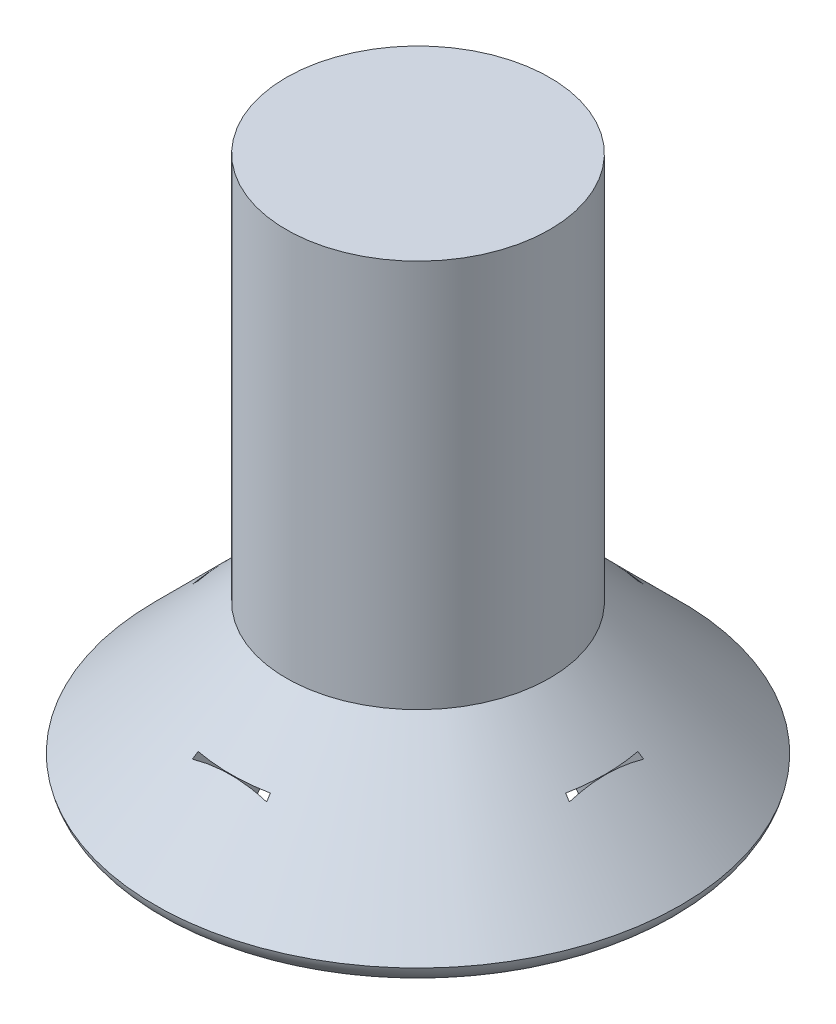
ISO-10303-21;
HEADER;
FILE_DESCRIPTION(('STEP AP214'),'2;1');
FILE_NAME('part.step','',(''),(''),'','','');
FILE_SCHEMA(('AUTOMOTIVE_DESIGN { 1 0 10303 214 1 1 1 1 }'));
ENDSEC;
DATA;
#1=APPLICATION_CONTEXT('core data for automotive mechanical design processes');
#2=APPLICATION_PROTOCOL_DEFINITION('international standard','automotive_design',2000,#1);
#3=PRODUCT_CONTEXT('',#1,'mechanical');
#4=PRODUCT('Part','Part','',(#3));
#5=PRODUCT_RELATED_PRODUCT_CATEGORY('part','',(#4));
#6=PRODUCT_DEFINITION_FORMATION('','',#4);
#7=PRODUCT_DEFINITION_CONTEXT('part definition',#1,'design');
#8=PRODUCT_DEFINITION('design','',#6,#7);
#9=PRODUCT_DEFINITION_SHAPE('','',#8);
#10=(LENGTH_UNIT() NAMED_UNIT(*) SI_UNIT(.MILLI.,.METRE.));
#11=(NAMED_UNIT(*) PLANE_ANGLE_UNIT() SI_UNIT($,.RADIAN.));
#12=(NAMED_UNIT(*) SI_UNIT($,.STERADIAN.) SOLID_ANGLE_UNIT());
#13=UNCERTAINTY_MEASURE_WITH_UNIT(LENGTH_MEASURE(1.E-05),#10,'distance_accuracy_value','');
#14=(GEOMETRIC_REPRESENTATION_CONTEXT(3) GLOBAL_UNCERTAINTY_ASSIGNED_CONTEXT((#13)) GLOBAL_UNIT_ASSIGNED_CONTEXT((#10,
#11,#12)) REPRESENTATION_CONTEXT('',''));
#15=CARTESIAN_POINT('',(0.,0.,0.));
#16=DIRECTION('',(0.,0.,1.));
#17=DIRECTION('',(1.,0.,0.));
#18=AXIS2_PLACEMENT_3D('',#15,#16,#17);
#19=CARTESIAN_POINT('',(0.,3.9,0.));
#20=DIRECTION('',(0.,1.,0.));
#21=DIRECTION('',(-1.,0.,0.));
#22=AXIS2_PLACEMENT_3D('',#19,#20,#21);
#23=PLANE('',#22);
#24=CARTESIAN_POINT('',(0.,3.9,0.));
#25=DIRECTION('',(0.,-1.,0.));
#26=DIRECTION('',(1.,0.,0.));
#27=AXIS2_PLACEMENT_3D('',#24,#25,#26);
#28=CIRCLE('',#27,0.95);
#29=CARTESIAN_POINT('',(0.949999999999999,3.9,0.));
#30=VERTEX_POINT('',#29);
#31=EDGE_CURVE('E439',#30,#30,#28,.T.);
#32=ORIENTED_EDGE('',*,*,#31,.F.);
#33=EDGE_LOOP('',(#32));
#34=FACE_BOUND('',#33,.T.);
#35=ADVANCED_FACE('F33',(#34),#23,.T.);
#36=CARTESIAN_POINT('',(0.,0.,0.));
#37=DIRECTION('',(0.,-1.,0.));
#38=DIRECTION('',(1.,0.,0.));
#39=AXIS2_PLACEMENT_3D('',#36,#37,#38);
#40=CYLINDRICAL_SURFACE('',#39,0.95);
#41=ORIENTED_EDGE('',*,*,#31,.T.);
#42=EDGE_LOOP('',(#41));
#43=FACE_BOUND('',#42,.T.);
#44=CARTESIAN_POINT('',(0.,1.1,0.));
#45=DIRECTION('',(0.,-1.,0.));
#46=DIRECTION('',(1.,0.,0.));
#47=AXIS2_PLACEMENT_3D('',#44,#45,#46);
#48=CIRCLE('',#47,0.950000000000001);
#49=CARTESIAN_POINT('',(0.95,1.1,0.));
#50=VERTEX_POINT('',#49);
#51=EDGE_CURVE('E440',#50,#50,#48,.T.);
#52=ORIENTED_EDGE('',*,*,#51,.F.);
#53=EDGE_LOOP('',(#52));
#54=FACE_BOUND('',#53,.T.);
#55=ADVANCED_FACE('F427',(#43,#54),#40,.T.);
#56=CARTESIAN_POINT('',(0.,0.155104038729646,0.));
#57=DIRECTION('',(0.,-1.,0.));
#58=DIRECTION('',(1.,0.,0.));
#59=AXIS2_PLACEMENT_3D('',#56,#57,#58);
#60=CONICAL_SURFACE('',#59,1.89489596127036,0.785398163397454);
#61=CARTESIAN_POINT('',(-1.32448150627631,0.7002,-0.260209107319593));
#62=CARTESIAN_POINT('',(-1.35376827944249,0.670234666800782,-0.266578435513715));
#63=CARTESIAN_POINT('',(-1.38305487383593,0.640269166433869,-0.272947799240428));
#64=CARTESIAN_POINT('',(-1.44162770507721,0.580337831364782,-0.285686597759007));
#65=CARTESIAN_POINT('',(-1.47091394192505,0.550371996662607,-0.292056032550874));
#66=CARTESIAN_POINT('',(-1.50020000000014,0.520405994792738,-0.298425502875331));
#67=B_SPLINE_CURVE_WITH_KNOTS('',3,(#61,#62,#63,#64,#65,#66),.UNSPECIFIED.,.F.,.F.,(4,2,4),(0.,
0.127144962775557,0.254289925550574),.UNSPECIFIED.);
#68=CARTESIAN_POINT('',(-1.32467697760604,0.7,-0.260251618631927));
#69=VERTEX_POINT('',#68);
#70=CARTESIAN_POINT('',(-1.35858474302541,0.665306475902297,-0.267625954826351));
#71=VERTEX_POINT('',#70);
#72=EDGE_CURVE('E366',#69,#71,#67,.T.);
#73=ORIENTED_EDGE('',*,*,#72,.F.);
#74=CARTESIAN_POINT('',(0.,0.7,0.));
#75=DIRECTION('',(0.,-1.,0.));
#76=DIRECTION('',(0.,0.,-1.));
#77=AXIS2_PLACEMENT_3D('',#74,#75,#76);
#78=CIRCLE('',#77,1.35);
#79=CARTESIAN_POINT('',(-1.32467697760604,0.7,0.260251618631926));
#80=VERTEX_POINT('',#79);
#81=EDGE_CURVE('E11',#69,#80,#78,.F.);
#82=ORIENTED_EDGE('',*,*,#81,.T.);
#83=CARTESIAN_POINT('',(-1.5002,0.520405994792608,0.298425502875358));
#84=CARTESIAN_POINT('',(-1.47091394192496,0.550371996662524,0.292056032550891));
#85=CARTESIAN_POINT('',(-1.44162770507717,0.580337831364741,0.285686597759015));
#86=CARTESIAN_POINT('',(-1.38305487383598,0.64026916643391,0.272947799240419));
#87=CARTESIAN_POINT('',(-1.35376827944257,0.67023466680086,0.266578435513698));
#88=CARTESIAN_POINT('',(-1.32448150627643,0.700200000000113,0.260209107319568));
#89=B_SPLINE_CURVE_WITH_KNOTS('',3,(#83,#84,#85,#86,#87,#88),.UNSPECIFIED.,.F.,.F.,(4,2,4),(0.,
0.127144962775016,0.254289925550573),.UNSPECIFIED.);
#90=CARTESIAN_POINT('',(-1.35858474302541,0.665306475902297,0.26762595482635));
#91=VERTEX_POINT('',#90);
#92=EDGE_CURVE('E337',#91,#80,#89,.T.);
#93=ORIENTED_EDGE('',*,*,#92,.F.);
#94=CARTESIAN_POINT('',(-1.36770975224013,0.622376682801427,-0.409241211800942));
#95=CARTESIAN_POINT('',(-1.36511595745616,0.63457952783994,-0.375372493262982));
#96=CARTESIAN_POINT('',(-1.36277166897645,0.645608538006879,-0.341021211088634));
#97=CARTESIAN_POINT('',(-1.35867523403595,0.664880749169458,-0.271430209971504));
#98=CARTESIAN_POINT('',(-1.35692448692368,0.67311736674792,-0.236188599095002));
#99=CARTESIAN_POINT('',(-1.35417014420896,0.68607553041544,-0.16629238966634));
#100=CARTESIAN_POINT('',(-1.35314265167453,0.690909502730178,-0.131660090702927));
#101=CARTESIAN_POINT('',(-1.35180273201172,0.697213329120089,-0.0621136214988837));
#102=CARTESIAN_POINT('',(-1.35148944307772,0.698687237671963,-0.027199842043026));
#103=CARTESIAN_POINT('',(-1.35159476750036,0.698191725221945,0.0413625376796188));
#104=CARTESIAN_POINT('',(-1.35198783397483,0.696342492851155,0.0750121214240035));
#105=CARTESIAN_POINT('',(-1.35343241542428,0.689546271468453,0.142015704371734));
#106=CARTESIAN_POINT('',(-1.35448465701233,0.684595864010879,0.17536933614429));
#107=CARTESIAN_POINT('',(-1.35723551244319,0.671654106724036,0.242648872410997));
#108=CARTESIAN_POINT('',(-1.35895536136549,0.663562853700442,0.276554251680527));
#109=CARTESIAN_POINT('',(-1.36294376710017,0.644798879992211,0.343533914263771));
#110=CARTESIAN_POINT('',(-1.36521110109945,0.634131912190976,0.376609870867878));
#111=CARTESIAN_POINT('',(-1.36770975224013,0.622376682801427,0.409241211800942));
#112=B_SPLINE_CURVE_WITH_KNOTS('',3,(#94,#95,#96,#97,#98,#99,#100,#101,#102,#103,#104,#105,#106,
#107,#108,#109,#110,#111),.UNSPECIFIED.,.F.,.F.,(4,2,2,2,2,2,2,2,4),(0.,0.108315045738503,
0.21688371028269,0.321671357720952,0.426332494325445,0.527284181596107,0.628347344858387,
0.732930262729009,0.837281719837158),.UNSPECIFIED.);
#113=EDGE_CURVE('E343',#71,#91,#112,.T.);
#114=ORIENTED_EDGE('',*,*,#113,.F.);
#115=EDGE_LOOP('',(#73,#82,#93,#114));
#116=FACE_BOUND('',#115,.T.);
#117=CARTESIAN_POINT('',(-0.260209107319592,0.7002,1.32448150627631));
#118=CARTESIAN_POINT('',(-0.266578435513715,0.670234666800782,1.35376827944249));
#119=CARTESIAN_POINT('',(-0.272947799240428,0.640269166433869,1.38305487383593));
#120=CARTESIAN_POINT('',(-0.285686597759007,0.580337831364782,1.44162770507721));
#121=CARTESIAN_POINT('',(-0.292056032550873,0.550371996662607,1.47091394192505));
#122=CARTESIAN_POINT('',(-0.29842550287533,0.520405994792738,1.50020000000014));
#123=B_SPLINE_CURVE_WITH_KNOTS('',3,(#117,#118,#119,#120,#121,#122),.UNSPECIFIED.,.F.,.F.,(4,2,
4),(0.,0.127144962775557,0.254289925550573),.UNSPECIFIED.);
#124=CARTESIAN_POINT('',(-0.260251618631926,0.7,1.32467697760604));
#125=VERTEX_POINT('',#124);
#126=CARTESIAN_POINT('',(-0.26762595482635,0.665306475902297,1.35858474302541));
#127=VERTEX_POINT('',#126);
#128=EDGE_CURVE('E332',#125,#127,#123,.T.);
#129=ORIENTED_EDGE('',*,*,#128,.F.);
#130=CARTESIAN_POINT('',(0.260251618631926,0.7,1.32467697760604));
#131=VERTEX_POINT('',#130);
#132=EDGE_CURVE('E41',#125,#131,#78,.F.);
#133=ORIENTED_EDGE('',*,*,#132,.T.);
#134=CARTESIAN_POINT('',(0.298425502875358,0.520405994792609,1.5002));
#135=CARTESIAN_POINT('',(0.292056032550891,0.550371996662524,1.47091394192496));
#136=CARTESIAN_POINT('',(0.285686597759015,0.580337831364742,1.44162770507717));
#137=CARTESIAN_POINT('',(0.272947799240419,0.64026916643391,1.38305487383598));
#138=CARTESIAN_POINT('',(0.266578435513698,0.67023466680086,1.35376827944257));
#139=CARTESIAN_POINT('',(0.260209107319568,0.700200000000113,1.32448150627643));
#140=B_SPLINE_CURVE_WITH_KNOTS('',3,(#134,#135,#136,#137,#138,#139),.UNSPECIFIED.,.F.,.F.,(4,2,
4),(0.,0.127144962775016,0.254289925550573),.UNSPECIFIED.);
#141=CARTESIAN_POINT('',(0.26762595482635,0.665306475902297,1.35858474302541));
#142=VERTEX_POINT('',#141);
#143=EDGE_CURVE('E296',#142,#131,#140,.T.);
#144=ORIENTED_EDGE('',*,*,#143,.F.);
#145=CARTESIAN_POINT('',(-0.409241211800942,0.622376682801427,1.36770975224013));
#146=CARTESIAN_POINT('',(-0.375372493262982,0.634579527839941,1.36511595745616));
#147=CARTESIAN_POINT('',(-0.341021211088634,0.645608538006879,1.36277166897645));
#148=CARTESIAN_POINT('',(-0.271430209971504,0.664880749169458,1.35867523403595));
#149=CARTESIAN_POINT('',(-0.236188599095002,0.673117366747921,1.35692448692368));
#150=CARTESIAN_POINT('',(-0.16629238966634,0.68607553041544,1.35417014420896));
#151=CARTESIAN_POINT('',(-0.131660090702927,0.690909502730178,1.35314265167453));
#152=CARTESIAN_POINT('',(-0.0621136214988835,0.69721332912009,1.35180273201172));
#153=CARTESIAN_POINT('',(-0.0271998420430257,0.698687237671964,1.35148944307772));
#154=CARTESIAN_POINT('',(0.041362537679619,0.698191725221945,1.35159476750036));
#155=CARTESIAN_POINT('',(0.0750121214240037,0.696342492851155,1.35198783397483));
#156=CARTESIAN_POINT('',(0.142015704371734,0.689546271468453,1.35343241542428));
#157=CARTESIAN_POINT('',(0.17536933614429,0.684595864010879,1.35448465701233));
#158=CARTESIAN_POINT('',(0.242648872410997,0.671654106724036,1.35723551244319));
#159=CARTESIAN_POINT('',(0.276554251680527,0.663562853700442,1.35895536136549));
#160=CARTESIAN_POINT('',(0.343533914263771,0.644798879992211,1.36294376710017));
#161=CARTESIAN_POINT('',(0.376609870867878,0.634131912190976,1.36521110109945));
#162=CARTESIAN_POINT('',(0.409241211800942,0.622376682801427,1.36770975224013));
#163=B_SPLINE_CURVE_WITH_KNOTS('',3,(#145,#146,#147,#148,#149,#150,#151,#152,#153,#154,#155,
#156,#157,#158,#159,#160,#161,#162),.UNSPECIFIED.,.F.,.F.,(4,2,2,2,2,2,2,2,4),(0.,
0.108315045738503,0.21688371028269,0.321671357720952,0.426332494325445,0.527284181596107,
0.628347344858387,0.732930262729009,0.837281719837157),.UNSPECIFIED.);
#164=EDGE_CURVE('E327',#127,#142,#163,.T.);
#165=ORIENTED_EDGE('',*,*,#164,.F.);
#166=EDGE_LOOP('',(#129,#133,#144,#165));
#167=FACE_BOUND('',#166,.T.);
#168=CARTESIAN_POINT('',(1.36770975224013,0.622376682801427,0.409241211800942));
#169=CARTESIAN_POINT('',(1.36511595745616,0.634579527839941,0.375372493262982));
#170=CARTESIAN_POINT('',(1.36277166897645,0.645608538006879,0.341021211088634));
#171=CARTESIAN_POINT('',(1.35867523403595,0.664880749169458,0.271430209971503));
#172=CARTESIAN_POINT('',(1.35692448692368,0.673117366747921,0.236188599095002));
#173=CARTESIAN_POINT('',(1.35417014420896,0.68607553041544,0.16629238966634));
#174=CARTESIAN_POINT('',(1.35314265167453,0.690909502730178,0.131660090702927));
#175=CARTESIAN_POINT('',(1.35180273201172,0.69721332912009,0.0621136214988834));
#176=CARTESIAN_POINT('',(1.35148944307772,0.698687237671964,0.0271998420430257));
#177=CARTESIAN_POINT('',(1.35159476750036,0.698191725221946,-0.0413625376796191));
#178=CARTESIAN_POINT('',(1.35198783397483,0.696342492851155,-0.0750121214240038));
#179=CARTESIAN_POINT('',(1.35343241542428,0.689546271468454,-0.142015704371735));
#180=CARTESIAN_POINT('',(1.35448465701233,0.684595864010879,-0.17536933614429));
#181=CARTESIAN_POINT('',(1.35723551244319,0.671654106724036,-0.242648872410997));
#182=CARTESIAN_POINT('',(1.35895536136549,0.663562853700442,-0.276554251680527));
#183=CARTESIAN_POINT('',(1.36294376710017,0.644798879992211,-0.343533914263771));
#184=CARTESIAN_POINT('',(1.36521110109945,0.634131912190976,-0.376609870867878));
#185=CARTESIAN_POINT('',(1.36770975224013,0.622376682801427,-0.409241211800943));
#186=B_SPLINE_CURVE_WITH_KNOTS('',3,(#168,#169,#170,#171,#172,#173,#174,#175,#176,#177,#178,
#179,#180,#181,#182,#183,#184,#185),.UNSPECIFIED.,.F.,.F.,(4,2,2,2,2,2,2,2,4),(0.,
0.108315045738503,0.21688371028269,0.321671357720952,0.426332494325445,0.527284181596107,
0.628347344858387,0.732930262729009,0.837281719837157),.UNSPECIFIED.);
#187=CARTESIAN_POINT('',(1.35858474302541,0.665306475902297,0.26762595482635));
#188=VERTEX_POINT('',#187);
#189=CARTESIAN_POINT('',(1.35858474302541,0.665306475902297,-0.26762595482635));
#190=VERTEX_POINT('',#189);
#191=EDGE_CURVE('E410',#188,#190,#186,.T.);
#192=ORIENTED_EDGE('',*,*,#191,.F.);
#193=CARTESIAN_POINT('',(1.32448150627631,0.7002,0.260209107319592));
#194=CARTESIAN_POINT('',(1.35376827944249,0.670234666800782,0.266578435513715));
#195=CARTESIAN_POINT('',(1.38305487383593,0.640269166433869,0.272947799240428));
#196=CARTESIAN_POINT('',(1.44162770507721,0.580337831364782,0.285686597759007));
#197=CARTESIAN_POINT('',(1.47091394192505,0.550371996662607,0.292056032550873));
#198=CARTESIAN_POINT('',(1.50020000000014,0.520405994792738,0.29842550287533));
#199=B_SPLINE_CURVE_WITH_KNOTS('',3,(#193,#194,#195,#196,#197,#198),.UNSPECIFIED.,.F.,.F.,(4,2,
4),(0.,0.127144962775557,0.254289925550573),.UNSPECIFIED.);
#200=CARTESIAN_POINT('',(1.32467697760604,0.7,0.260251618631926));
#201=VERTEX_POINT('',#200);
#202=EDGE_CURVE('E241',#201,#188,#199,.T.);
#203=ORIENTED_EDGE('',*,*,#202,.F.);
#204=CARTESIAN_POINT('',(1.32467697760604,0.7,-0.260251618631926));
#205=VERTEX_POINT('',#204);
#206=EDGE_CURVE('E442',#201,#205,#78,.F.);
#207=ORIENTED_EDGE('',*,*,#206,.T.);
#208=CARTESIAN_POINT('',(1.5002,0.520405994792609,-0.298425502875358));
#209=CARTESIAN_POINT('',(1.47091394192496,0.550371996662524,-0.292056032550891));
#210=CARTESIAN_POINT('',(1.44162770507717,0.580337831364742,-0.285686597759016));
#211=CARTESIAN_POINT('',(1.38305487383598,0.64026916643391,-0.272947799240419));
#212=CARTESIAN_POINT('',(1.35376827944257,0.67023466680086,-0.266578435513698));
#213=CARTESIAN_POINT('',(1.32448150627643,0.700200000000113,-0.260209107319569));
#214=B_SPLINE_CURVE_WITH_KNOTS('',3,(#208,#209,#210,#211,#212,#213),.UNSPECIFIED.,.F.,.F.,(4,2,
4),(0.,0.127144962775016,0.254289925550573),.UNSPECIFIED.);
#215=EDGE_CURVE('E404',#190,#205,#214,.T.);
#216=ORIENTED_EDGE('',*,*,#215,.F.);
#217=EDGE_LOOP('',(#192,#203,#207,#216));
#218=FACE_BOUND('',#217,.T.);
#219=CARTESIAN_POINT('',(0.260209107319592,0.7002,-1.32448150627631));
#220=CARTESIAN_POINT('',(0.266578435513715,0.670234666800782,-1.35376827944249));
#221=CARTESIAN_POINT('',(0.272947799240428,0.640269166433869,-1.38305487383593));
#222=CARTESIAN_POINT('',(0.285686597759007,0.580337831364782,-1.44162770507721));
#223=CARTESIAN_POINT('',(0.292056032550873,0.550371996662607,-1.47091394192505));
#224=CARTESIAN_POINT('',(0.29842550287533,0.520405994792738,-1.50020000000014));
#225=B_SPLINE_CURVE_WITH_KNOTS('',3,(#219,#220,#221,#222,#223,#224),.UNSPECIFIED.,.F.,.F.,(4,2,
4),(0.,0.127144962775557,0.254289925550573),.UNSPECIFIED.);
#226=CARTESIAN_POINT('',(0.260251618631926,0.7,-1.32467697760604));
#227=VERTEX_POINT('',#226);
#228=CARTESIAN_POINT('',(0.26762595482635,0.665306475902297,-1.35858474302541));
#229=VERTEX_POINT('',#228);
#230=EDGE_CURVE('E399',#227,#229,#225,.T.);
#231=ORIENTED_EDGE('',*,*,#230,.F.);
#232=CARTESIAN_POINT('',(-0.260251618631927,0.7,-1.32467697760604));
#233=VERTEX_POINT('',#232);
#234=EDGE_CURVE('E36',#227,#233,#78,.F.);
#235=ORIENTED_EDGE('',*,*,#234,.T.);
#236=CARTESIAN_POINT('',(-0.298425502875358,0.520405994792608,-1.5002));
#237=CARTESIAN_POINT('',(-0.292056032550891,0.550371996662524,-1.47091394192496));
#238=CARTESIAN_POINT('',(-0.285686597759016,0.580337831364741,-1.44162770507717));
#239=CARTESIAN_POINT('',(-0.272947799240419,0.64026916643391,-1.38305487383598));
#240=CARTESIAN_POINT('',(-0.266578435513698,0.67023466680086,-1.35376827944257));
#241=CARTESIAN_POINT('',(-0.260209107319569,0.700200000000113,-1.32448150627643));
#242=B_SPLINE_CURVE_WITH_KNOTS('',3,(#236,#237,#238,#239,#240,#241),.UNSPECIFIED.,.F.,.F.,(4,2,
4),(0.,0.127144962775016,0.254289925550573),.UNSPECIFIED.);
#243=CARTESIAN_POINT('',(-0.26762595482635,0.665306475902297,-1.35858474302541));
#244=VERTEX_POINT('',#243);
#245=EDGE_CURVE('E371',#244,#233,#242,.T.);
#246=ORIENTED_EDGE('',*,*,#245,.F.);
#247=CARTESIAN_POINT('',(0.409241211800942,0.622376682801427,-1.36770975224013));
#248=CARTESIAN_POINT('',(0.375372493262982,0.63457952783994,-1.36511595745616));
#249=CARTESIAN_POINT('',(0.341021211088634,0.645608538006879,-1.36277166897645));
#250=CARTESIAN_POINT('',(0.271430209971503,0.664880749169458,-1.35867523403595));
#251=CARTESIAN_POINT('',(0.236188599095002,0.67311736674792,-1.35692448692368));
#252=CARTESIAN_POINT('',(0.16629238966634,0.68607553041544,-1.35417014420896));
#253=CARTESIAN_POINT('',(0.131660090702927,0.690909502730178,-1.35314265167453));
#254=CARTESIAN_POINT('',(0.0621136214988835,0.697213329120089,-1.35180273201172));
#255=CARTESIAN_POINT('',(0.0271998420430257,0.698687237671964,-1.35148944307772));
#256=CARTESIAN_POINT('',(-0.041362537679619,0.698191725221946,-1.35159476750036));
#257=CARTESIAN_POINT('',(-0.0750121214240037,0.696342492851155,-1.35198783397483));
#258=CARTESIAN_POINT('',(-0.142015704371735,0.689546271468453,-1.35343241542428));
#259=CARTESIAN_POINT('',(-0.17536933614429,0.684595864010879,-1.35448465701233));
#260=CARTESIAN_POINT('',(-0.242648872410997,0.671654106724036,-1.35723551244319));
#261=CARTESIAN_POINT('',(-0.276554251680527,0.663562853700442,-1.35895536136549));
#262=CARTESIAN_POINT('',(-0.343533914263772,0.644798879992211,-1.36294376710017));
#263=CARTESIAN_POINT('',(-0.376609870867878,0.634131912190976,-1.36521110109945));
#264=CARTESIAN_POINT('',(-0.409241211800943,0.622376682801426,-1.36770975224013));
#265=B_SPLINE_CURVE_WITH_KNOTS('',3,(#247,#248,#249,#250,#251,#252,#253,#254,#255,#256,#257,
#258,#259,#260,#261,#262,#263,#264),.UNSPECIFIED.,.F.,.F.,(4,2,2,2,2,2,2,2,4),(0.,
0.108315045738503,0.21688371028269,0.321671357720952,0.426332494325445,0.527284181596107,
0.628347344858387,0.732930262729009,0.837281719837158),.UNSPECIFIED.);
#266=EDGE_CURVE('E377',#229,#244,#265,.T.);
#267=ORIENTED_EDGE('',*,*,#266,.F.);
#268=EDGE_LOOP('',(#231,#235,#246,#267));
#269=FACE_BOUND('',#268,.T.);
#270=ORIENTED_EDGE('',*,*,#51,.T.);
#271=EDGE_LOOP('',(#270));
#272=FACE_BOUND('',#271,.T.);
#273=CARTESIAN_POINT('',(0.,0.155104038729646,0.));
#274=DIRECTION('',(0.,-1.,0.));
#275=DIRECTION('',(1.,0.,0.));
#276=AXIS2_PLACEMENT_3D('',#273,#274,#275);
#277=CIRCLE('',#276,1.89489596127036);
#278=CARTESIAN_POINT('',(1.89489596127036,0.155104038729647,0.));
#279=VERTEX_POINT('',#278);
#280=EDGE_CURVE('E444',#279,#279,#277,.T.);
#281=ORIENTED_EDGE('',*,*,#280,.F.);
#282=EDGE_LOOP('',(#281));
#283=FACE_BOUND('',#282,.T.);
#284=ADVANCED_FACE('F302',(#116,#167,#218,#269,#272,#283),#60,.T.);
#285=CARTESIAN_POINT('',(0.,0.199999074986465,0.));
#286=DIRECTION('',(0.,-1.,0.));
#287=DIRECTION('',(1.,0.,0.));
#288=AXIS2_PLACEMENT_3D('',#285,#286,#287);
#289=TOROIDAL_SURFACE('',#288,1.7,0.2);
#290=ORIENTED_EDGE('',*,*,#280,.T.);
#291=EDGE_LOOP('',(#290));
#292=FACE_BOUND('',#291,.T.);
#293=CARTESIAN_POINT('',(0.,0.,0.));
#294=DIRECTION('',(0.,-1.,0.));
#295=DIRECTION('',(1.,0.,0.));
#296=AXIS2_PLACEMENT_3D('',#293,#294,#295);
#297=CIRCLE('',#296,1.69939172);
#298=CARTESIAN_POINT('',(1.69939172,0.,0.));
#299=VERTEX_POINT('',#298);
#300=EDGE_CURVE('E447',#299,#299,#297,.T.);
#301=ORIENTED_EDGE('',*,*,#300,.F.);
#302=EDGE_LOOP('',(#301));
#303=FACE_BOUND('',#302,.T.);
#304=ADVANCED_FACE('F421',(#292,#303),#289,.T.);
#305=CARTESIAN_POINT('',(0.,0.,0.));
#306=DIRECTION('',(0.,-1.,0.));
#307=DIRECTION('',(1.,0.,0.));
#308=AXIS2_PLACEMENT_3D('',#305,#306,#307);
#309=PLANE('',#308);
#310=DIRECTION('',(0.,0.,1.));
#311=VECTOR('',#310,1.);
#312=CARTESIAN_POINT('',(1.5,0.,0.409041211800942));
#313=LINE('',#312,#311);
#314=CARTESIAN_POINT('',(1.5,0.,-0.409041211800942));
#315=VERTEX_POINT('',#314);
#316=CARTESIAN_POINT('',(1.5,0.,0.409041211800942));
#317=VERTEX_POINT('',#316);
#318=EDGE_CURVE('E191',#315,#317,#313,.T.);
#319=ORIENTED_EDGE('',*,*,#318,.F.);
#320=DIRECTION('',(1.,0.,0.));
#321=VECTOR('',#320,1.);
#322=CARTESIAN_POINT('',(1.5,0.,-0.409041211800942));
#323=LINE('',#322,#321);
#324=CARTESIAN_POINT('',(0.941832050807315,0.,-0.409041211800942));
#325=VERTEX_POINT('',#324);
#326=EDGE_CURVE('E235',#325,#315,#323,.T.);
#327=ORIENTED_EDGE('',*,*,#326,.F.);
#328=CARTESIAN_POINT('',(0.941832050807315,0.,-0.941832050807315));
#329=DIRECTION('',(0.,1.,0.));
#330=DIRECTION('',(0.,0.,-1.));
#331=AXIS2_PLACEMENT_3D('',#328,#329,#330);
#332=CIRCLE('',#331,0.532790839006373);
#333=CARTESIAN_POINT('',(0.409041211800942,0.,-0.941832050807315));
#334=VERTEX_POINT('',#333);
#335=EDGE_CURVE('E232',#334,#325,#332,.T.);
#336=ORIENTED_EDGE('',*,*,#335,.F.);
#337=DIRECTION('',(0.,0.,1.));
#338=VECTOR('',#337,1.);
#339=CARTESIAN_POINT('',(0.409041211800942,0.,-1.5));
#340=LINE('',#339,#338);
#341=CARTESIAN_POINT('',(0.409041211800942,0.,-1.5));
#342=VERTEX_POINT('',#341);
#343=EDGE_CURVE('E229',#342,#334,#340,.T.);
#344=ORIENTED_EDGE('',*,*,#343,.F.);
#345=DIRECTION('',(1.,0.,0.));
#346=VECTOR('',#345,1.);
#347=CARTESIAN_POINT('',(0.409041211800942,0.,-1.5));
#348=LINE('',#347,#346);
#349=CARTESIAN_POINT('',(-0.409041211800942,0.,-1.5));
#350=VERTEX_POINT('',#349);
#351=EDGE_CURVE('E226',#350,#342,#348,.T.);
#352=ORIENTED_EDGE('',*,*,#351,.F.);
#353=DIRECTION('',(0.,0.,-1.));
#354=VECTOR('',#353,1.);
#355=CARTESIAN_POINT('',(-0.409041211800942,0.,-1.5));
#356=LINE('',#355,#354);
#357=CARTESIAN_POINT('',(-0.409041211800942,0.,-0.941832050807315));
#358=VERTEX_POINT('',#357);
#359=EDGE_CURVE('E223',#358,#350,#356,.T.);
#360=ORIENTED_EDGE('',*,*,#359,.F.);
#361=CARTESIAN_POINT('',(-0.941832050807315,0.,-0.941832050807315));
#362=DIRECTION('',(0.,1.,0.));
#363=DIRECTION('',(0.,0.,-1.));
#364=AXIS2_PLACEMENT_3D('',#361,#362,#363);
#365=CIRCLE('',#364,0.532790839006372);
#366=CARTESIAN_POINT('',(-0.941832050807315,0.,-0.409041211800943));
#367=VERTEX_POINT('',#366);
#368=EDGE_CURVE('E220',#367,#358,#365,.T.);
#369=ORIENTED_EDGE('',*,*,#368,.F.);
#370=DIRECTION('',(1.,0.,0.));
#371=VECTOR('',#370,1.);
#372=CARTESIAN_POINT('',(-1.5,0.,-0.409041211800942));
#373=LINE('',#372,#371);
#374=CARTESIAN_POINT('',(-1.5,0.,-0.409041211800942));
#375=VERTEX_POINT('',#374);
#376=EDGE_CURVE('E217',#375,#367,#373,.T.);
#377=ORIENTED_EDGE('',*,*,#376,.F.);
#378=DIRECTION('',(0.,0.,-1.));
#379=VECTOR('',#378,1.);
#380=CARTESIAN_POINT('',(-1.5,0.,-0.409041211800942));
#381=LINE('',#380,#379);
#382=CARTESIAN_POINT('',(-1.5,0.,0.409041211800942));
#383=VERTEX_POINT('',#382);
#384=EDGE_CURVE('E214',#383,#375,#381,.T.);
#385=ORIENTED_EDGE('',*,*,#384,.F.);
#386=DIRECTION('',(-1.,0.,0.));
#387=VECTOR('',#386,1.);
#388=CARTESIAN_POINT('',(-1.5,0.,0.409041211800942));
#389=LINE('',#388,#387);
#390=CARTESIAN_POINT('',(-0.941832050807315,0.,0.409041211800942));
#391=VERTEX_POINT('',#390);
#392=EDGE_CURVE('E211',#391,#383,#389,.T.);
#393=ORIENTED_EDGE('',*,*,#392,.F.);
#394=CARTESIAN_POINT('',(-0.941832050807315,0.,0.941832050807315));
#395=DIRECTION('',(0.,1.,0.));
#396=DIRECTION('',(0.,0.,-1.));
#397=AXIS2_PLACEMENT_3D('',#394,#395,#396);
#398=CIRCLE('',#397,0.532790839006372);
#399=CARTESIAN_POINT('',(-0.409041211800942,0.,0.941832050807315));
#400=VERTEX_POINT('',#399);
#401=EDGE_CURVE('E208',#400,#391,#398,.T.);
#402=ORIENTED_EDGE('',*,*,#401,.F.);
#403=DIRECTION('',(0.,0.,-1.));
#404=VECTOR('',#403,1.);
#405=CARTESIAN_POINT('',(-0.409041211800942,0.,1.5));
#406=LINE('',#405,#404);
#407=CARTESIAN_POINT('',(-0.409041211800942,0.,1.5));
#408=VERTEX_POINT('',#407);
#409=EDGE_CURVE('E205',#408,#400,#406,.T.);
#410=ORIENTED_EDGE('',*,*,#409,.F.);
#411=DIRECTION('',(-1.,0.,0.));
#412=VECTOR('',#411,1.);
#413=CARTESIAN_POINT('',(-0.409041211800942,0.,1.5));
#414=LINE('',#413,#412);
#415=CARTESIAN_POINT('',(0.409041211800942,0.,1.5));
#416=VERTEX_POINT('',#415);
#417=EDGE_CURVE('E199',#416,#408,#414,.T.);
#418=ORIENTED_EDGE('',*,*,#417,.F.);
#419=DIRECTION('',(0.,0.,1.));
#420=VECTOR('',#419,1.);
#421=CARTESIAN_POINT('',(0.409041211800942,0.,1.5));
#422=LINE('',#421,#420);
#423=CARTESIAN_POINT('',(0.409041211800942,0.,0.941832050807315));
#424=VERTEX_POINT('',#423);
#425=EDGE_CURVE('E197',#424,#416,#422,.T.);
#426=ORIENTED_EDGE('',*,*,#425,.F.);
#427=CARTESIAN_POINT('',(0.941832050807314,0.,0.941832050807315));
#428=DIRECTION('',(0.,1.,0.));
#429=DIRECTION('',(0.,0.,1.));
#430=AXIS2_PLACEMENT_3D('',#427,#428,#429);
#431=CIRCLE('',#430,0.532790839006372);
#432=CARTESIAN_POINT('',(0.941832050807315,0.,0.409041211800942));
#433=VERTEX_POINT('',#432);
#434=EDGE_CURVE('E176',#433,#424,#431,.T.);
#435=ORIENTED_EDGE('',*,*,#434,.F.);
#436=DIRECTION('',(-1.,0.,0.));
#437=VECTOR('',#436,1.);
#438=CARTESIAN_POINT('',(1.5,0.,0.409041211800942));
#439=LINE('',#438,#437);
#440=EDGE_CURVE('E186',#317,#433,#439,.T.);
#441=ORIENTED_EDGE('',*,*,#440,.F.);
#442=EDGE_LOOP('',(#319,#327,#336,#344,#352,#360,#369,#377,#385,#393,#402,#410,#418,#426,#435,#441));
#443=FACE_BOUND('',#442,.T.);
#444=ORIENTED_EDGE('',*,*,#300,.T.);
#445=EDGE_LOOP('',(#444));
#446=FACE_BOUND('',#445,.T.);
#447=ADVANCED_FACE('F193',(#443,#446),#309,.T.);
#448=CARTESIAN_POINT('',(1.5,0.,0.409041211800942));
#449=DIRECTION('',(0.978147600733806,0.20791169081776,0.));
#450=DIRECTION('',(-0.20791169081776,0.978147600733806,0.));
#451=AXIS2_PLACEMENT_3D('',#448,#449,#450);
#452=PLANE('',#451);
#453=ORIENTED_EDGE('',*,*,#191,.T.);
#454=DIRECTION('',(0.203558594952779,-0.957667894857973,-0.203558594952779));
#455=VECTOR('',#454,1.);
#456=CARTESIAN_POINT('',(1.5,0.,-0.409041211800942));
#457=LINE('',#456,#455);
#458=EDGE_CURVE('E239',#190,#315,#457,.T.);
#459=ORIENTED_EDGE('',*,*,#458,.T.);
#460=ORIENTED_EDGE('',*,*,#318,.T.);
#461=DIRECTION('',(0.203558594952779,-0.957667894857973,0.203558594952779));
#462=VECTOR('',#461,1.);
#463=CARTESIAN_POINT('',(1.5,0.,0.409041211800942));
#464=LINE('',#463,#462);
#465=EDGE_CURVE('E182',#188,#317,#464,.T.);
#466=ORIENTED_EDGE('',*,*,#465,.F.);
#467=EDGE_LOOP('',(#453,#459,#460,#466));
#468=FACE_BOUND('',#467,.T.);
#469=ADVANCED_FACE('F310',(#468),#452,.F.);
#470=CARTESIAN_POINT('',(1.5,0.,-0.409041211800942));
#471=DIRECTION('',(0.,0.20791169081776,-0.978147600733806));
#472=DIRECTION('',(0.,0.978147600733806,0.20791169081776));
#473=AXIS2_PLACEMENT_3D('',#470,#471,#472);
#474=PLANE('',#473);
#475=ORIENTED_EDGE('',*,*,#215,.T.);
#476=DIRECTION('',(1.,0.,0.));
#477=VECTOR('',#476,1.);
#478=CARTESIAN_POINT('',(0.941832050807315,0.7,-0.260251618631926));
#479=LINE('',#478,#477);
#480=CARTESIAN_POINT('',(0.941832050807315,0.7,-0.260251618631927));
#481=VERTEX_POINT('',#480);
#482=EDGE_CURVE('E243',#481,#205,#479,.T.);
#483=ORIENTED_EDGE('',*,*,#482,.F.);
#484=DIRECTION('',(0.,-0.978147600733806,-0.20791169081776));
#485=VECTOR('',#484,1.);
#486=CARTESIAN_POINT('',(0.941832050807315,0.,-0.409041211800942));
#487=LINE('',#486,#485);
#488=EDGE_CURVE('E242',#481,#325,#487,.T.);
#489=ORIENTED_EDGE('',*,*,#488,.T.);
#490=ORIENTED_EDGE('',*,*,#326,.T.);
#491=ORIENTED_EDGE('',*,*,#458,.F.);
#492=EDGE_LOOP('',(#475,#483,#489,#490,#491));
#493=FACE_BOUND('',#492,.T.);
#494=ADVANCED_FACE('F415',(#493),#474,.F.);
#495=CARTESIAN_POINT('',(0.941832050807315,0.,-0.941832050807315));
#496=DIRECTION('',(0.,1.,0.));
#497=DIRECTION('',(0.,0.,-1.));
#498=AXIS2_PLACEMENT_3D('',#495,#496,#497);
#499=CONICAL_SURFACE('',#498,0.532790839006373,0.20943951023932);
#500=ORIENTED_EDGE('',*,*,#335,.T.);
#501=ORIENTED_EDGE('',*,*,#488,.F.);
#502=CARTESIAN_POINT('',(0.941832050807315,0.7,-0.941832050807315));
#503=DIRECTION('',(0.,-1.,0.));
#504=DIRECTION('',(0.,0.,-1.));
#505=AXIS2_PLACEMENT_3D('',#502,#503,#504);
#506=CIRCLE('',#505,0.681580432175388);
#507=CARTESIAN_POINT('',(0.260251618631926,0.7,-0.941832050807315));
#508=VERTEX_POINT('',#507);
#509=EDGE_CURVE('E270',#508,#481,#506,.F.);
#510=ORIENTED_EDGE('',*,*,#509,.F.);
#511=DIRECTION('',(0.20791169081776,-0.978147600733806,0.));
#512=VECTOR('',#511,1.);
#513=CARTESIAN_POINT('',(0.409041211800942,0.,-0.941832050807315));
#514=LINE('',#513,#512);
#515=EDGE_CURVE('E266',#508,#334,#514,.T.);
#516=ORIENTED_EDGE('',*,*,#515,.T.);
#517=EDGE_LOOP('',(#500,#501,#510,#516));
#518=FACE_BOUND('',#517,.T.);
#519=ADVANCED_FACE('F396',(#518),#499,.T.);
#520=CARTESIAN_POINT('',(0.409041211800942,0.,-1.5));
#521=DIRECTION('',(0.978147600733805,0.20791169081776,0.));
#522=DIRECTION('',(-0.20791169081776,0.978147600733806,0.));
#523=AXIS2_PLACEMENT_3D('',#520,#521,#522);
#524=PLANE('',#523);
#525=ORIENTED_EDGE('',*,*,#230,.T.);
#526=DIRECTION('',(0.203558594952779,-0.957667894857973,-0.203558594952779));
#527=VECTOR('',#526,1.);
#528=CARTESIAN_POINT('',(0.409041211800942,0.,-1.5));
#529=LINE('',#528,#527);
#530=EDGE_CURVE('E264',#229,#342,#529,.T.);
#531=ORIENTED_EDGE('',*,*,#530,.T.);
#532=ORIENTED_EDGE('',*,*,#343,.T.);
#533=ORIENTED_EDGE('',*,*,#515,.F.);
#534=DIRECTION('',(0.,0.,1.));
#535=VECTOR('',#534,1.);
#536=CARTESIAN_POINT('',(0.260251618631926,0.7,-0.941832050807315));
#537=LINE('',#536,#535);
#538=EDGE_CURVE('E273',#227,#508,#537,.T.);
#539=ORIENTED_EDGE('',*,*,#538,.F.);
#540=EDGE_LOOP('',(#525,#531,#532,#533,#539));
#541=FACE_BOUND('',#540,.T.);
#542=ADVANCED_FACE('F391',(#541),#524,.F.);
#543=CARTESIAN_POINT('',(0.409041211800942,0.,-1.5));
#544=DIRECTION('',(0.,0.20791169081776,-0.978147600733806));
#545=DIRECTION('',(0.,0.978147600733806,0.20791169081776));
#546=AXIS2_PLACEMENT_3D('',#543,#544,#545);
#547=PLANE('',#546);
#548=ORIENTED_EDGE('',*,*,#266,.T.);
#549=DIRECTION('',(-0.203558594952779,-0.957667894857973,-0.203558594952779));
#550=VECTOR('',#549,1.);
#551=CARTESIAN_POINT('',(-0.409041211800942,0.,-1.5));
#552=LINE('',#551,#550);
#553=EDGE_CURVE('E262',#244,#350,#552,.T.);
#554=ORIENTED_EDGE('',*,*,#553,.T.);
#555=ORIENTED_EDGE('',*,*,#351,.T.);
#556=ORIENTED_EDGE('',*,*,#530,.F.);
#557=EDGE_LOOP('',(#548,#554,#555,#556));
#558=FACE_BOUND('',#557,.T.);
#559=ADVANCED_FACE('F386',(#558),#547,.F.);
#560=CARTESIAN_POINT('',(-0.409041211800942,0.,-1.5));
#561=DIRECTION('',(-0.978147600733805,0.20791169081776,0.));
#562=DIRECTION('',(-0.20791169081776,-0.978147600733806,0.));
#563=AXIS2_PLACEMENT_3D('',#560,#561,#562);
#564=PLANE('',#563);
#565=ORIENTED_EDGE('',*,*,#245,.T.);
#566=DIRECTION('',(0.,0.,-1.));
#567=VECTOR('',#566,1.);
#568=CARTESIAN_POINT('',(-0.260251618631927,0.7,-0.941832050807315));
#569=LINE('',#568,#567);
#570=CARTESIAN_POINT('',(-0.260251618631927,0.7,-0.941832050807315));
#571=VERTEX_POINT('',#570);
#572=EDGE_CURVE('E275',#571,#233,#569,.T.);
#573=ORIENTED_EDGE('',*,*,#572,.F.);
#574=DIRECTION('',(-0.20791169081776,-0.978147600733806,0.));
#575=VECTOR('',#574,1.);
#576=CARTESIAN_POINT('',(-0.409041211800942,0.,-0.941832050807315));
#577=LINE('',#576,#575);
#578=EDGE_CURVE('E260',#571,#358,#577,.T.);
#579=ORIENTED_EDGE('',*,*,#578,.T.);
#580=ORIENTED_EDGE('',*,*,#359,.T.);
#581=ORIENTED_EDGE('',*,*,#553,.F.);
#582=EDGE_LOOP('',(#565,#573,#579,#580,#581));
#583=FACE_BOUND('',#582,.T.);
#584=ADVANCED_FACE('F383',(#583),#564,.F.);
#585=CARTESIAN_POINT('',(-0.941832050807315,0.,-0.941832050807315));
#586=DIRECTION('',(0.,1.,0.));
#587=DIRECTION('',(0.,0.,-1.));
#588=AXIS2_PLACEMENT_3D('',#585,#586,#587);
#589=CONICAL_SURFACE('',#588,0.532790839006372,0.20943951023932);
#590=ORIENTED_EDGE('',*,*,#368,.T.);
#591=ORIENTED_EDGE('',*,*,#578,.F.);
#592=CARTESIAN_POINT('',(-0.941832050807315,0.7,-0.941832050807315));
#593=DIRECTION('',(0.,-1.,0.));
#594=DIRECTION('',(0.,0.,-1.));
#595=AXIS2_PLACEMENT_3D('',#592,#593,#594);
#596=CIRCLE('',#595,0.681580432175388);
#597=CARTESIAN_POINT('',(-0.941832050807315,0.7,-0.260251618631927));
#598=VERTEX_POINT('',#597);
#599=EDGE_CURVE('E277',#598,#571,#596,.F.);
#600=ORIENTED_EDGE('',*,*,#599,.F.);
#601=DIRECTION('',(0.,-0.978147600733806,-0.20791169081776));
#602=VECTOR('',#601,1.);
#603=CARTESIAN_POINT('',(-0.941832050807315,0.,-0.409041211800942));
#604=LINE('',#603,#602);
#605=EDGE_CURVE('E258',#598,#367,#604,.T.);
#606=ORIENTED_EDGE('',*,*,#605,.T.);
#607=EDGE_LOOP('',(#590,#591,#600,#606));
#608=FACE_BOUND('',#607,.T.);
#609=ADVANCED_FACE('F363',(#608),#589,.T.);
#610=CARTESIAN_POINT('',(-1.5,0.,-0.409041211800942));
#611=DIRECTION('',(0.,0.20791169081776,-0.978147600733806));
#612=DIRECTION('',(0.,0.978147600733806,0.20791169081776));
#613=AXIS2_PLACEMENT_3D('',#610,#611,#612);
#614=PLANE('',#613);
#615=ORIENTED_EDGE('',*,*,#72,.T.);
#616=DIRECTION('',(-0.203558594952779,-0.957667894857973,-0.203558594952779));
#617=VECTOR('',#616,1.);
#618=CARTESIAN_POINT('',(-1.5,0.,-0.409041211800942));
#619=LINE('',#618,#617);
#620=EDGE_CURVE('E256',#71,#375,#619,.T.);
#621=ORIENTED_EDGE('',*,*,#620,.T.);
#622=ORIENTED_EDGE('',*,*,#376,.T.);
#623=ORIENTED_EDGE('',*,*,#605,.F.);
#624=DIRECTION('',(1.,0.,0.));
#625=VECTOR('',#624,1.);
#626=CARTESIAN_POINT('',(0.941832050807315,0.7,-0.260251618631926));
#627=LINE('',#626,#625);
#628=EDGE_CURVE('E280',#69,#598,#627,.T.);
#629=ORIENTED_EDGE('',*,*,#628,.F.);
#630=EDGE_LOOP('',(#615,#621,#622,#623,#629));
#631=FACE_BOUND('',#630,.T.);
#632=ADVANCED_FACE('F358',(#631),#614,.F.);
#633=CARTESIAN_POINT('',(-1.5,0.,-0.409041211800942));
#634=DIRECTION('',(-0.978147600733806,0.20791169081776,0.));
#635=DIRECTION('',(-0.20791169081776,-0.978147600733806,0.));
#636=AXIS2_PLACEMENT_3D('',#633,#634,#635);
#637=PLANE('',#636);
#638=ORIENTED_EDGE('',*,*,#113,.T.);
#639=DIRECTION('',(-0.203558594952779,-0.957667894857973,0.203558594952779));
#640=VECTOR('',#639,1.);
#641=CARTESIAN_POINT('',(-1.5,0.,0.409041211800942));
#642=LINE('',#641,#640);
#643=EDGE_CURVE('E254',#91,#383,#642,.T.);
#644=ORIENTED_EDGE('',*,*,#643,.T.);
#645=ORIENTED_EDGE('',*,*,#384,.T.);
#646=ORIENTED_EDGE('',*,*,#620,.F.);
#647=EDGE_LOOP('',(#638,#644,#645,#646));
#648=FACE_BOUND('',#647,.T.);
#649=ADVANCED_FACE('F353',(#648),#637,.F.);
#650=CARTESIAN_POINT('',(-1.5,0.,0.409041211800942));
#651=DIRECTION('',(0.,0.20791169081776,0.978147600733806));
#652=DIRECTION('',(0.,-0.978147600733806,0.20791169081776));
#653=AXIS2_PLACEMENT_3D('',#650,#651,#652);
#654=PLANE('',#653);
#655=ORIENTED_EDGE('',*,*,#92,.T.);
#656=DIRECTION('',(-1.,0.,0.));
#657=VECTOR('',#656,1.);
#658=CARTESIAN_POINT('',(0.941832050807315,0.7,0.260251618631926));
#659=LINE('',#658,#657);
#660=CARTESIAN_POINT('',(-0.941832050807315,0.7,0.260251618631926));
#661=VERTEX_POINT('',#660);
#662=EDGE_CURVE('E48',#661,#80,#659,.T.);
#663=ORIENTED_EDGE('',*,*,#662,.F.);
#664=DIRECTION('',(0.,-0.978147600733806,0.20791169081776));
#665=VECTOR('',#664,1.);
#666=CARTESIAN_POINT('',(-0.941832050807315,0.,0.409041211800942));
#667=LINE('',#666,#665);
#668=EDGE_CURVE('E252',#661,#391,#667,.T.);
#669=ORIENTED_EDGE('',*,*,#668,.T.);
#670=ORIENTED_EDGE('',*,*,#392,.T.);
#671=ORIENTED_EDGE('',*,*,#643,.F.);
#672=EDGE_LOOP('',(#655,#663,#669,#670,#671));
#673=FACE_BOUND('',#672,.T.);
#674=ADVANCED_FACE('F349',(#673),#654,.F.);
#675=CARTESIAN_POINT('',(-0.941832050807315,0.,0.941832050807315));
#676=DIRECTION('',(0.,1.,0.));
#677=DIRECTION('',(0.,0.,-1.));
#678=AXIS2_PLACEMENT_3D('',#675,#676,#677);
#679=CONICAL_SURFACE('',#678,0.532790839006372,0.20943951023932);
#680=ORIENTED_EDGE('',*,*,#401,.T.);
#681=ORIENTED_EDGE('',*,*,#668,.F.);
#682=CARTESIAN_POINT('',(-0.941832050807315,0.7,0.941832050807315));
#683=DIRECTION('',(0.,-1.,0.));
#684=DIRECTION('',(0.,0.,-1.));
#685=AXIS2_PLACEMENT_3D('',#682,#683,#684);
#686=CIRCLE('',#685,0.681580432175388);
#687=CARTESIAN_POINT('',(-0.260251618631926,0.7,0.941832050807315));
#688=VERTEX_POINT('',#687);
#689=EDGE_CURVE('E283',#688,#661,#686,.F.);
#690=ORIENTED_EDGE('',*,*,#689,.F.);
#691=DIRECTION('',(-0.20791169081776,-0.978147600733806,0.));
#692=VECTOR('',#691,1.);
#693=CARTESIAN_POINT('',(-0.409041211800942,0.,0.941832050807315));
#694=LINE('',#693,#692);
#695=EDGE_CURVE('E250',#688,#400,#694,.T.);
#696=ORIENTED_EDGE('',*,*,#695,.T.);
#697=EDGE_LOOP('',(#680,#681,#690,#696));
#698=FACE_BOUND('',#697,.T.);
#699=ADVANCED_FACE('F352',(#698),#679,.T.);
#700=CARTESIAN_POINT('',(-0.409041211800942,0.,1.5));
#701=DIRECTION('',(-0.978147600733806,0.20791169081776,0.));
#702=DIRECTION('',(-0.20791169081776,-0.978147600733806,0.));
#703=AXIS2_PLACEMENT_3D('',#700,#701,#702);
#704=PLANE('',#703);
#705=ORIENTED_EDGE('',*,*,#128,.T.);
#706=DIRECTION('',(-0.203558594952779,-0.957667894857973,0.203558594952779));
#707=VECTOR('',#706,1.);
#708=CARTESIAN_POINT('',(-0.409041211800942,0.,1.5));
#709=LINE('',#708,#707);
#710=EDGE_CURVE('E248',#127,#408,#709,.T.);
#711=ORIENTED_EDGE('',*,*,#710,.T.);
#712=ORIENTED_EDGE('',*,*,#409,.T.);
#713=ORIENTED_EDGE('',*,*,#695,.F.);
#714=DIRECTION('',(0.,0.,-1.));
#715=VECTOR('',#714,1.);
#716=CARTESIAN_POINT('',(-0.260251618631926,0.7,-0.941832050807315));
#717=LINE('',#716,#715);
#718=EDGE_CURVE('E285',#125,#688,#717,.T.);
#719=ORIENTED_EDGE('',*,*,#718,.F.);
#720=EDGE_LOOP('',(#705,#711,#712,#713,#719));
#721=FACE_BOUND('',#720,.T.);
#722=ADVANCED_FACE('F323',(#721),#704,.F.);
#723=CARTESIAN_POINT('',(-0.409041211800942,0.,1.5));
#724=DIRECTION('',(0.,0.20791169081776,0.978147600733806));
#725=DIRECTION('',(0.,-0.978147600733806,0.20791169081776));
#726=AXIS2_PLACEMENT_3D('',#723,#724,#725);
#727=PLANE('',#726);
#728=ORIENTED_EDGE('',*,*,#164,.T.);
#729=DIRECTION('',(0.203558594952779,-0.957667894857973,0.203558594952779));
#730=VECTOR('',#729,1.);
#731=CARTESIAN_POINT('',(0.409041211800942,0.,1.5));
#732=LINE('',#731,#730);
#733=EDGE_CURVE('E246',#142,#416,#732,.T.);
#734=ORIENTED_EDGE('',*,*,#733,.T.);
#735=ORIENTED_EDGE('',*,*,#417,.T.);
#736=ORIENTED_EDGE('',*,*,#710,.F.);
#737=EDGE_LOOP('',(#728,#734,#735,#736));
#738=FACE_BOUND('',#737,.T.);
#739=ADVANCED_FACE('F318',(#738),#727,.F.);
#740=CARTESIAN_POINT('',(0.409041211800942,0.,1.5));
#741=DIRECTION('',(0.978147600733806,0.20791169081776,0.));
#742=DIRECTION('',(-0.20791169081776,0.978147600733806,0.));
#743=AXIS2_PLACEMENT_3D('',#740,#741,#742);
#744=PLANE('',#743);
#745=ORIENTED_EDGE('',*,*,#143,.T.);
#746=DIRECTION('',(0.,0.,1.));
#747=VECTOR('',#746,1.);
#748=CARTESIAN_POINT('',(0.260251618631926,0.7,-0.941832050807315));
#749=LINE('',#748,#747);
#750=CARTESIAN_POINT('',(0.260251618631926,0.7,0.941832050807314));
#751=VERTEX_POINT('',#750);
#752=EDGE_CURVE('E55',#751,#131,#749,.T.);
#753=ORIENTED_EDGE('',*,*,#752,.F.);
#754=DIRECTION('',(0.20791169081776,-0.978147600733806,0.));
#755=VECTOR('',#754,1.);
#756=CARTESIAN_POINT('',(0.409041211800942,0.,0.941832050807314));
#757=LINE('',#756,#755);
#758=EDGE_CURVE('E181',#751,#424,#757,.T.);
#759=ORIENTED_EDGE('',*,*,#758,.T.);
#760=ORIENTED_EDGE('',*,*,#425,.T.);
#761=ORIENTED_EDGE('',*,*,#733,.F.);
#762=EDGE_LOOP('',(#745,#753,#759,#760,#761));
#763=FACE_BOUND('',#762,.T.);
#764=ADVANCED_FACE('F314',(#763),#744,.F.);
#765=CARTESIAN_POINT('',(0.941832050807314,0.,0.941832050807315));
#766=DIRECTION('',(0.,1.,0.));
#767=DIRECTION('',(0.,0.,1.));
#768=AXIS2_PLACEMENT_3D('',#765,#766,#767);
#769=CONICAL_SURFACE('',#768,0.532790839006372,0.20943951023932);
#770=ORIENTED_EDGE('',*,*,#434,.T.);
#771=ORIENTED_EDGE('',*,*,#758,.F.);
#772=CARTESIAN_POINT('',(0.941832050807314,0.7,0.941832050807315));
#773=DIRECTION('',(0.,-1.,0.));
#774=DIRECTION('',(0.,0.,-1.));
#775=AXIS2_PLACEMENT_3D('',#772,#773,#774);
#776=CIRCLE('',#775,0.681580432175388);
#777=CARTESIAN_POINT('',(0.941832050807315,0.7,0.260251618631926));
#778=VERTEX_POINT('',#777);
#779=EDGE_CURVE('E178',#778,#751,#776,.F.);
#780=ORIENTED_EDGE('',*,*,#779,.F.);
#781=DIRECTION('',(0.,-0.978147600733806,0.20791169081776));
#782=VECTOR('',#781,1.);
#783=CARTESIAN_POINT('',(0.941832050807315,0.,0.409041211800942));
#784=LINE('',#783,#782);
#785=EDGE_CURVE('E172',#778,#433,#784,.T.);
#786=ORIENTED_EDGE('',*,*,#785,.T.);
#787=EDGE_LOOP('',(#770,#771,#780,#786));
#788=FACE_BOUND('',#787,.T.);
#789=ADVANCED_FACE('F174',(#788),#769,.T.);
#790=CARTESIAN_POINT('',(1.5,0.,0.409041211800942));
#791=DIRECTION('',(0.,0.20791169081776,0.978147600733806));
#792=DIRECTION('',(0.,-0.978147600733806,0.20791169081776));
#793=AXIS2_PLACEMENT_3D('',#790,#791,#792);
#794=PLANE('',#793);
#795=ORIENTED_EDGE('',*,*,#202,.T.);
#796=ORIENTED_EDGE('',*,*,#465,.T.);
#797=ORIENTED_EDGE('',*,*,#440,.T.);
#798=ORIENTED_EDGE('',*,*,#785,.F.);
#799=DIRECTION('',(-1.,0.,0.));
#800=VECTOR('',#799,1.);
#801=CARTESIAN_POINT('',(0.941832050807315,0.7,0.260251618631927));
#802=LINE('',#801,#800);
#803=EDGE_CURVE('E238',#201,#778,#802,.T.);
#804=ORIENTED_EDGE('',*,*,#803,.F.);
#805=EDGE_LOOP('',(#795,#796,#797,#798,#804));
#806=FACE_BOUND('',#805,.T.);
#807=ADVANCED_FACE('F187',(#806),#794,.F.);
#808=CARTESIAN_POINT('',(0.941832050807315,0.7,-0.941832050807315));
#809=DIRECTION('',(0.,-1.,0.));
#810=DIRECTION('',(0.,0.,-1.));
#811=AXIS2_PLACEMENT_3D('',#808,#809,#810);
#812=PLANE('',#811);
#813=ORIENTED_EDGE('',*,*,#628,.T.);
#814=ORIENTED_EDGE('',*,*,#599,.T.);
#815=ORIENTED_EDGE('',*,*,#572,.T.);
#816=ORIENTED_EDGE('',*,*,#234,.F.);
#817=ORIENTED_EDGE('',*,*,#538,.T.);
#818=ORIENTED_EDGE('',*,*,#509,.T.);
#819=ORIENTED_EDGE('',*,*,#482,.T.);
#820=ORIENTED_EDGE('',*,*,#206,.F.);
#821=ORIENTED_EDGE('',*,*,#803,.T.);
#822=ORIENTED_EDGE('',*,*,#779,.T.);
#823=ORIENTED_EDGE('',*,*,#752,.T.);
#824=ORIENTED_EDGE('',*,*,#132,.F.);
#825=ORIENTED_EDGE('',*,*,#718,.T.);
#826=ORIENTED_EDGE('',*,*,#689,.T.);
#827=ORIENTED_EDGE('',*,*,#662,.T.);
#828=ORIENTED_EDGE('',*,*,#81,.F.);
#829=EDGE_LOOP('',(#813,#814,#815,#816,#817,#818,#819,#820,#821,#822,#823,#824,#825,#826,#827,#828));
#830=FACE_BOUND('',#829,.T.);
#831=ADVANCED_FACE('F309',(#830),#812,.T.);
#832=CLOSED_SHELL('',(#35,#55,#284,#304,#447,#469,#494,#519,#542,#559,#584,#609,#632,#649,#674,
#699,#722,#739,#764,#789,#807,#831));
#833=MANIFOLD_SOLID_BREP('B2',#832);
#834=ADVANCED_BREP_SHAPE_REPRESENTATION('',(#18,#833),#14);
#835=SHAPE_DEFINITION_REPRESENTATION(#9,#834);
ENDSEC;
END-ISO-10303-21;
